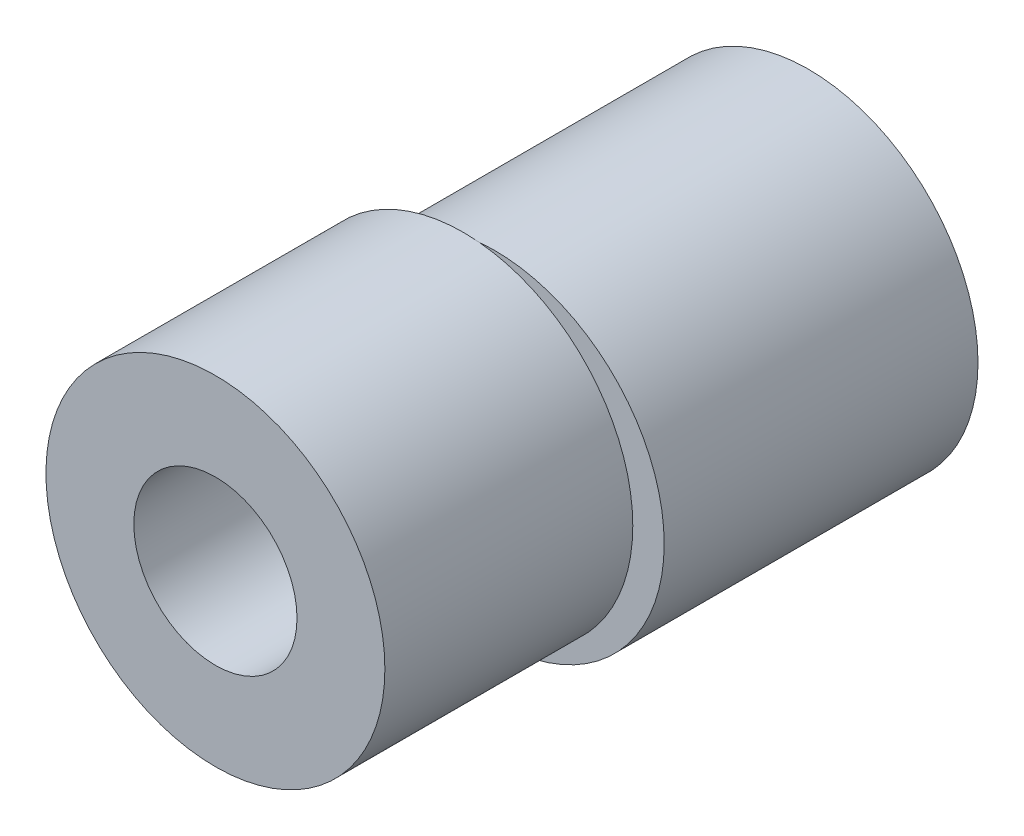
from build123d import *

# Parameters (mm, degrees)
SKIZZE1_R                       = 5.4
AUFSATZ_LINEAR_AUSTRAGEN1_DEPTH = 10
SKIZZE2_R                       = 5.4
AUFSATZ_LINEAR_AUSTRAGEN2_DEPTH = 7.9
SCHNITT_LINEAR_AUSTRAGEN1_REACH = 21.762
SKIZZE3_R                       = 2.6
SKIZZE5_W                       = 0.5
SKIZZE5_H                       = 3.980603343
AUFSATZ_LINEAR_AUSTRAGEN3_DEPTH = 7.9


with BuildPart() as part:
    # Skizze1 → Aufsatz-Linear austragen1 (new body)
    with BuildSketch(Plane.XY):
        Circle(SKIZZE1_R)
    extrude(amount=AUFSATZ_LINEAR_AUSTRAGEN1_DEPTH)

    # Skizze2 → Aufsatz-Linear austragen2 (add)
    with BuildSketch(Plane.XY.offset(10)):
        with Locations(Location((-1, 0, 0), (0, 0, 275.312774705))):
            Circle(SKIZZE2_R)
    extrude(amount=AUFSATZ_LINEAR_AUSTRAGEN2_DEPTH)

    # Skizze3 → Schnitt-Linear austragen1 (cut, up to next)
    with BuildSketch(Plane.XY.offset(17.9), mode=Mode.PRIVATE) as schnitt_linear_austragen1_sk1:
        with Locations((-1, 0)):
            Circle(SKIZZE3_R)
    schnitt_linear_austragen1_tool1 = extrude(schnitt_linear_austragen1_sk1.sketch, amount=-SCHNITT_LINEAR_AUSTRAGEN1_REACH, mode=Mode.PRIVATE) & part.part
    add(schnitt_linear_austragen1_tool1.solids().sort_by_distance((-1, 0, 17.9))[0], mode=Mode.SUBTRACT)

    # Skizze5 → Aufsatz-Linear austragen3 (add)
    with BuildSketch(Plane(origin=(0, 0, 0), x_dir=(-1, 0, 0), z_dir=(0, 0, -1))):
        with Locations((3.325, -0.423657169)):
            Rectangle(SKIZZE5_W, SKIZZE5_H)
    extrude(amount=-AUFSATZ_LINEAR_AUSTRAGEN3_DEPTH)


solid = part.part
